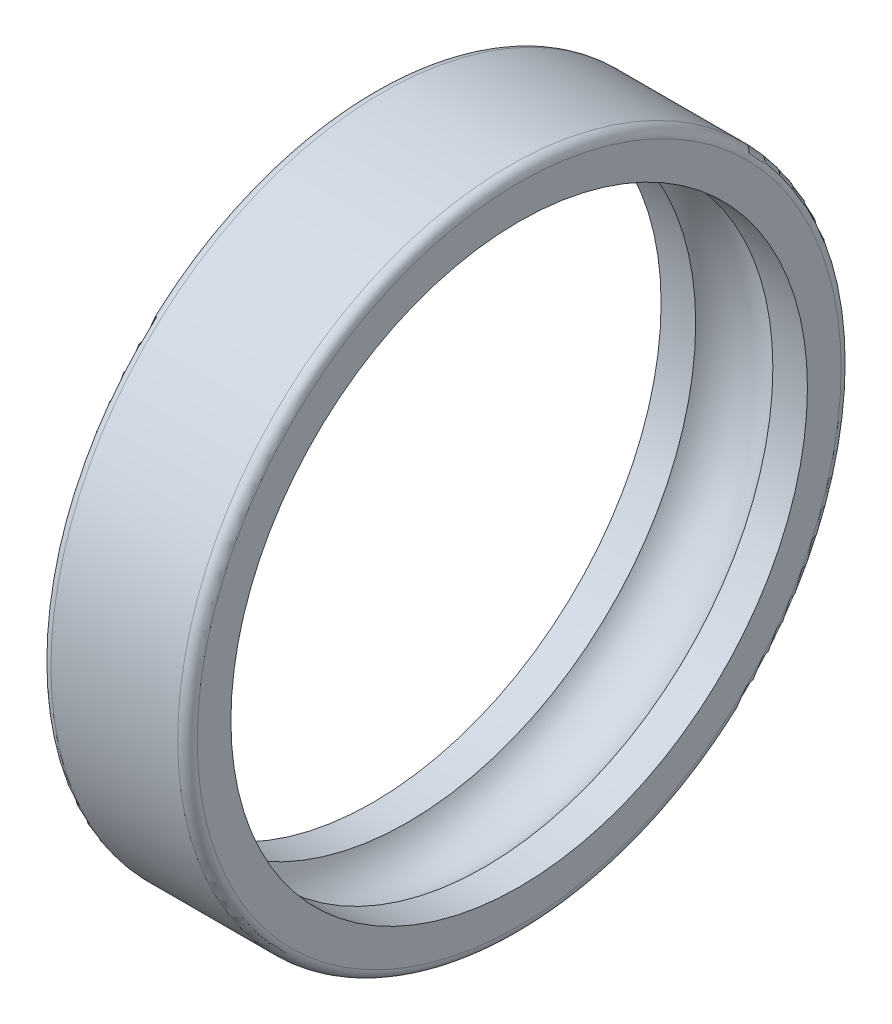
ISO-10303-21;
HEADER;
FILE_DESCRIPTION(('STEP AP214'),'2;1');
FILE_NAME('part.step','',(''),(''),'','','');
FILE_SCHEMA(('AUTOMOTIVE_DESIGN { 1 0 10303 214 1 1 1 1 }'));
ENDSEC;
DATA;
#1=APPLICATION_CONTEXT('core data for automotive mechanical design processes');
#2=APPLICATION_PROTOCOL_DEFINITION('international standard','automotive_design',2000,#1);
#3=PRODUCT_CONTEXT('',#1,'mechanical');
#4=PRODUCT('Part','Part','',(#3));
#5=PRODUCT_RELATED_PRODUCT_CATEGORY('part','',(#4));
#6=PRODUCT_DEFINITION_FORMATION('','',#4);
#7=PRODUCT_DEFINITION_CONTEXT('part definition',#1,'design');
#8=PRODUCT_DEFINITION('design','',#6,#7);
#9=PRODUCT_DEFINITION_SHAPE('','',#8);
#10=(LENGTH_UNIT() NAMED_UNIT(*) SI_UNIT(.MILLI.,.METRE.));
#11=(NAMED_UNIT(*) PLANE_ANGLE_UNIT() SI_UNIT($,.RADIAN.));
#12=(NAMED_UNIT(*) SI_UNIT($,.STERADIAN.) SOLID_ANGLE_UNIT());
#13=UNCERTAINTY_MEASURE_WITH_UNIT(LENGTH_MEASURE(1.E-05),#10,'distance_accuracy_value','');
#14=(GEOMETRIC_REPRESENTATION_CONTEXT(3) GLOBAL_UNCERTAINTY_ASSIGNED_CONTEXT((#13)) GLOBAL_UNIT_ASSIGNED_CONTEXT((#10,
#11,#12)) REPRESENTATION_CONTEXT('',''));
#15=CARTESIAN_POINT('',(0.,0.,0.));
#16=DIRECTION('',(0.,0.,1.));
#17=DIRECTION('',(1.,0.,0.));
#18=AXIS2_PLACEMENT_3D('',#15,#16,#17);
#19=CARTESIAN_POINT('',(0.,33.,0.));
#20=DIRECTION('',(1.,0.,0.));
#21=DIRECTION('',(0.,0.,-1.));
#22=AXIS2_PLACEMENT_3D('',#19,#20,#21);
#23=PLANE('',#22);
#24=CARTESIAN_POINT('',(0.,0.,0.));
#25=DIRECTION('',(-1.,0.,0.));
#26=DIRECTION('',(0.,0.,1.));
#27=AXIS2_PLACEMENT_3D('',#24,#25,#26);
#28=CIRCLE('',#27,29.55);
#29=CARTESIAN_POINT('',(0.,0.,29.55));
#30=VERTEX_POINT('',#29);
#31=EDGE_CURVE('E10',#30,#30,#28,.T.);
#32=ORIENTED_EDGE('',*,*,#31,.F.);
#33=EDGE_LOOP('',(#32));
#34=FACE_BOUND('',#33,.T.);
#35=CARTESIAN_POINT('',(0.,0.,0.));
#36=DIRECTION('',(-1.,0.,0.));
#37=DIRECTION('',(0.,0.,1.));
#38=AXIS2_PLACEMENT_3D('',#35,#36,#37);
#39=CIRCLE('',#38,33.);
#40=CARTESIAN_POINT('',(0.,0.,33.));
#41=VERTEX_POINT('',#40);
#42=EDGE_CURVE('E56',#41,#41,#39,.T.);
#43=ORIENTED_EDGE('',*,*,#42,.T.);
#44=EDGE_LOOP('',(#43));
#45=FACE_BOUND('',#44,.T.);
#46=ADVANCED_FACE('F28',(#34,#45),#23,.F.);
#47=CARTESIAN_POINT('',(0.,0.,0.));
#48=DIRECTION('',(-1.,0.,0.));
#49=DIRECTION('',(0.,0.,1.));
#50=AXIS2_PLACEMENT_3D('',#47,#48,#49);
#51=CYLINDRICAL_SURFACE('',#50,29.55);
#52=CARTESIAN_POINT('',(3.54371983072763,0.,0.));
#53=DIRECTION('',(-1.,0.,0.));
#54=DIRECTION('',(0.,0.,1.));
#55=AXIS2_PLACEMENT_3D('',#52,#53,#54);
#56=CIRCLE('',#55,29.55);
#57=CARTESIAN_POINT('',(3.54371983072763,0.,29.55));
#58=VERTEX_POINT('',#57);
#59=EDGE_CURVE('E34',#58,#58,#56,.T.);
#60=ORIENTED_EDGE('',*,*,#59,.F.);
#61=EDGE_LOOP('',(#60));
#62=FACE_BOUND('',#61,.T.);
#63=ORIENTED_EDGE('',*,*,#31,.T.);
#64=EDGE_LOOP('',(#63));
#65=FACE_BOUND('',#64,.T.);
#66=ADVANCED_FACE('F93',(#62,#65),#51,.F.);
#67=CARTESIAN_POINT('',(7.5,0.,0.));
#68=DIRECTION('',(-1.,0.,0.));
#69=DIRECTION('',(0.,0.,1.));
#70=AXIS2_PLACEMENT_3D('',#67,#68,#69);
#71=TOROIDAL_SURFACE('',#70,27.075,4.66666666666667);
#72=ORIENTED_EDGE('',*,*,#59,.T.);
#73=EDGE_LOOP('',(#72));
#74=FACE_BOUND('',#73,.T.);
#75=CARTESIAN_POINT('',(11.4562801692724,0.,0.));
#76=DIRECTION('',(-1.,0.,0.));
#77=DIRECTION('',(0.,0.,1.));
#78=AXIS2_PLACEMENT_3D('',#75,#76,#77);
#79=CIRCLE('',#78,29.55);
#80=CARTESIAN_POINT('',(11.4562801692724,0.,29.55));
#81=VERTEX_POINT('',#80);
#82=EDGE_CURVE('E38',#81,#81,#79,.T.);
#83=ORIENTED_EDGE('',*,*,#82,.F.);
#84=EDGE_LOOP('',(#83));
#85=FACE_BOUND('',#84,.T.);
#86=ADVANCED_FACE('F88',(#74,#85),#71,.F.);
#87=CARTESIAN_POINT('',(0.,0.,0.));
#88=DIRECTION('',(-1.,0.,0.));
#89=DIRECTION('',(0.,0.,1.));
#90=AXIS2_PLACEMENT_3D('',#87,#88,#89);
#91=CYLINDRICAL_SURFACE('',#90,29.55);
#92=CARTESIAN_POINT('',(15.,0.,0.));
#93=DIRECTION('',(-1.,0.,0.));
#94=DIRECTION('',(0.,0.,1.));
#95=AXIS2_PLACEMENT_3D('',#92,#93,#94);
#96=CIRCLE('',#95,29.55);
#97=CARTESIAN_POINT('',(15.,0.,29.55));
#98=VERTEX_POINT('',#97);
#99=EDGE_CURVE('E42',#98,#98,#96,.T.);
#100=ORIENTED_EDGE('',*,*,#99,.F.);
#101=EDGE_LOOP('',(#100));
#102=FACE_BOUND('',#101,.T.);
#103=ORIENTED_EDGE('',*,*,#82,.T.);
#104=EDGE_LOOP('',(#103));
#105=FACE_BOUND('',#104,.T.);
#106=ADVANCED_FACE('F82',(#102,#105),#91,.F.);
#107=CARTESIAN_POINT('',(15.,29.55,0.));
#108=DIRECTION('',(-1.,0.,0.));
#109=DIRECTION('',(0.,0.,1.));
#110=AXIS2_PLACEMENT_3D('',#107,#108,#109);
#111=PLANE('',#110);
#112=CARTESIAN_POINT('',(15.,0.,0.));
#113=DIRECTION('',(-1.,0.,0.));
#114=DIRECTION('',(0.,0.,1.));
#115=AXIS2_PLACEMENT_3D('',#112,#113,#114);
#116=CIRCLE('',#115,33.);
#117=CARTESIAN_POINT('',(15.,0.,33.));
#118=VERTEX_POINT('',#117);
#119=EDGE_CURVE('E47',#118,#118,#116,.T.);
#120=ORIENTED_EDGE('',*,*,#119,.F.);
#121=EDGE_LOOP('',(#120));
#122=FACE_BOUND('',#121,.T.);
#123=ORIENTED_EDGE('',*,*,#99,.T.);
#124=EDGE_LOOP('',(#123));
#125=FACE_BOUND('',#124,.T.);
#126=ADVANCED_FACE('F76',(#122,#125),#111,.F.);
#127=CARTESIAN_POINT('',(14.,0.,0.));
#128=DIRECTION('',(-1.,0.,0.));
#129=DIRECTION('',(0.,0.,1.));
#130=AXIS2_PLACEMENT_3D('',#127,#128,#129);
#131=TOROIDAL_SURFACE('',#130,33.,1.);
#132=CARTESIAN_POINT('',(14.,0.,0.));
#133=DIRECTION('',(-1.,0.,0.));
#134=DIRECTION('',(0.,0.,1.));
#135=AXIS2_PLACEMENT_3D('',#132,#133,#134);
#136=CIRCLE('',#135,34.);
#137=CARTESIAN_POINT('',(14.,0.,34.));
#138=VERTEX_POINT('',#137);
#139=EDGE_CURVE('E50',#138,#138,#136,.T.);
#140=ORIENTED_EDGE('',*,*,#139,.F.);
#141=EDGE_LOOP('',(#140));
#142=FACE_BOUND('',#141,.T.);
#143=ORIENTED_EDGE('',*,*,#119,.T.);
#144=EDGE_LOOP('',(#143));
#145=FACE_BOUND('',#144,.T.);
#146=ADVANCED_FACE('F70',(#142,#145),#131,.T.);
#147=CARTESIAN_POINT('',(0.,0.,0.));
#148=DIRECTION('',(-1.,0.,0.));
#149=DIRECTION('',(0.,0.,1.));
#150=AXIS2_PLACEMENT_3D('',#147,#148,#149);
#151=CYLINDRICAL_SURFACE('',#150,34.);
#152=CARTESIAN_POINT('',(1.,0.,0.));
#153=DIRECTION('',(-1.,0.,0.));
#154=DIRECTION('',(0.,0.,1.));
#155=AXIS2_PLACEMENT_3D('',#152,#153,#154);
#156=CIRCLE('',#155,34.);
#157=CARTESIAN_POINT('',(1.,0.,34.));
#158=VERTEX_POINT('',#157);
#159=EDGE_CURVE('E53',#158,#158,#156,.T.);
#160=ORIENTED_EDGE('',*,*,#159,.F.);
#161=EDGE_LOOP('',(#160));
#162=FACE_BOUND('',#161,.T.);
#163=ORIENTED_EDGE('',*,*,#139,.T.);
#164=EDGE_LOOP('',(#163));
#165=FACE_BOUND('',#164,.T.);
#166=ADVANCED_FACE('F64',(#162,#165),#151,.T.);
#167=CARTESIAN_POINT('',(1.,0.,0.));
#168=DIRECTION('',(-1.,0.,0.));
#169=DIRECTION('',(0.,0.,1.));
#170=AXIS2_PLACEMENT_3D('',#167,#168,#169);
#171=TOROIDAL_SURFACE('',#170,33.,1.);
#172=ORIENTED_EDGE('',*,*,#42,.F.);
#173=EDGE_LOOP('',(#172));
#174=FACE_BOUND('',#173,.T.);
#175=ORIENTED_EDGE('',*,*,#159,.T.);
#176=EDGE_LOOP('',(#175));
#177=FACE_BOUND('',#176,.T.);
#178=ADVANCED_FACE('F61',(#174,#177),#171,.T.);
#179=CLOSED_SHELL('',(#46,#66,#86,#106,#126,#146,#166,#178));
#180=MANIFOLD_SOLID_BREP('B2',#179);
#181=ADVANCED_BREP_SHAPE_REPRESENTATION('',(#18,#180),#14);
#182=SHAPE_DEFINITION_REPRESENTATION(#9,#181);
ENDSEC;
END-ISO-10303-21;
